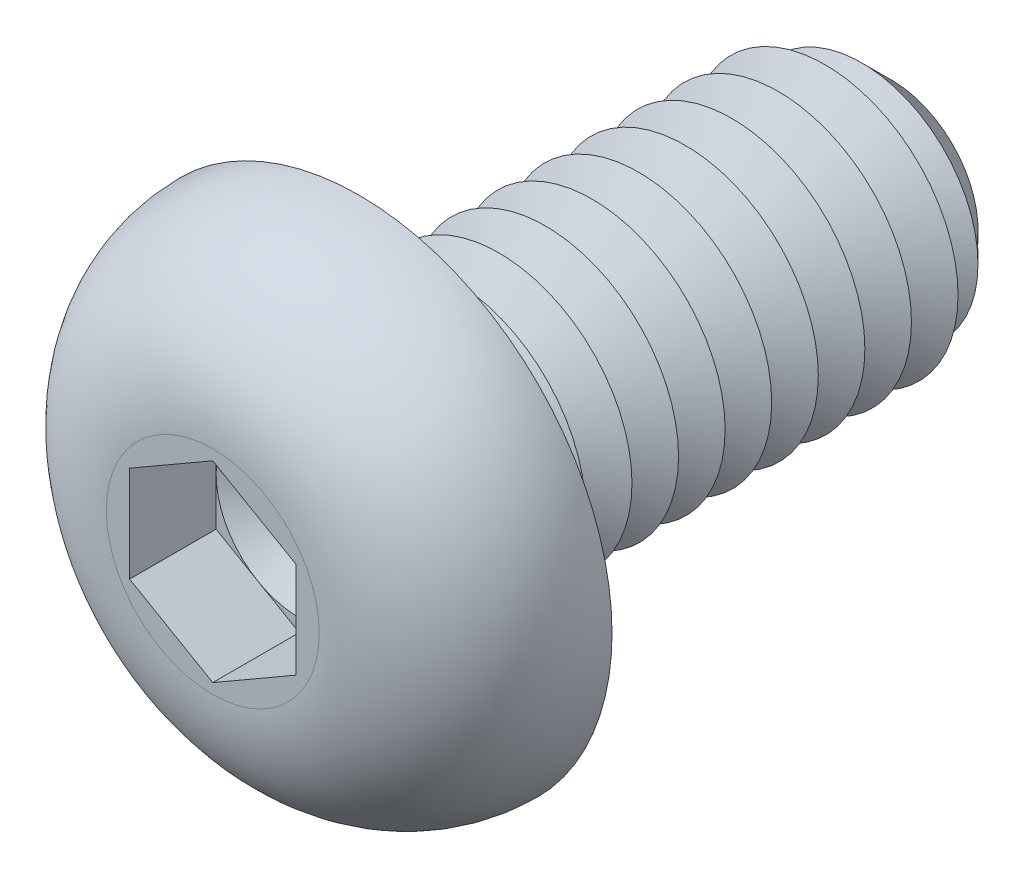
ISO-10303-21;
HEADER;
FILE_DESCRIPTION(('STEP AP214'),'2;1');
FILE_NAME('part.step','',(''),(''),'','','');
FILE_SCHEMA(('AUTOMOTIVE_DESIGN { 1 0 10303 214 1 1 1 1 }'));
ENDSEC;
DATA;
#1=APPLICATION_CONTEXT('core data for automotive mechanical design processes');
#2=APPLICATION_PROTOCOL_DEFINITION('international standard','automotive_design',2000,#1);
#3=PRODUCT_CONTEXT('',#1,'mechanical');
#4=PRODUCT('Part','Part','',(#3));
#5=PRODUCT_RELATED_PRODUCT_CATEGORY('part','',(#4));
#6=PRODUCT_DEFINITION_FORMATION('','',#4);
#7=PRODUCT_DEFINITION_CONTEXT('part definition',#1,'design');
#8=PRODUCT_DEFINITION('design','',#6,#7);
#9=PRODUCT_DEFINITION_SHAPE('','',#8);
#10=(LENGTH_UNIT() NAMED_UNIT(*) SI_UNIT(.MILLI.,.METRE.));
#11=(NAMED_UNIT(*) PLANE_ANGLE_UNIT() SI_UNIT($,.RADIAN.));
#12=(NAMED_UNIT(*) SI_UNIT($,.STERADIAN.) SOLID_ANGLE_UNIT());
#13=UNCERTAINTY_MEASURE_WITH_UNIT(LENGTH_MEASURE(1.E-05),#10,'distance_accuracy_value','');
#14=(GEOMETRIC_REPRESENTATION_CONTEXT(3) GLOBAL_UNCERTAINTY_ASSIGNED_CONTEXT((#13)) GLOBAL_UNIT_ASSIGNED_CONTEXT((#10,
#11,#12)) REPRESENTATION_CONTEXT('',''));
#15=CARTESIAN_POINT('',(0.,0.,0.));
#16=DIRECTION('',(0.,0.,1.));
#17=DIRECTION('',(1.,0.,0.));
#18=AXIS2_PLACEMENT_3D('',#15,#16,#17);
#19=CARTESIAN_POINT('',(0.,0.,0.900000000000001));
#20=DIRECTION('',(0.,0.,1.));
#21=DIRECTION('',(1.,0.,0.));
#22=AXIS2_PLACEMENT_3D('',#19,#20,#21);
#23=PLANE('',#22);
#24=CARTESIAN_POINT('',(0.,0.,0.900000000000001));
#25=DIRECTION('',(0.,0.,1.));
#26=DIRECTION('',(1.,0.,0.));
#27=AXIS2_PLACEMENT_3D('',#24,#25,#26);
#28=CIRCLE('',#27,1.25);
#29=CARTESIAN_POINT('',(1.25,0.,0.900000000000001));
#30=VERTEX_POINT('',#29);
#31=CARTESIAN_POINT('',(0.625,1.08253175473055,0.900000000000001));
#32=VERTEX_POINT('',#31);
#33=EDGE_CURVE('E117',#30,#32,#28,.T.);
#34=ORIENTED_EDGE('',*,*,#33,.F.);
#35=DIRECTION('',(0.,1.,0.));
#36=VECTOR('',#35,1.);
#37=CARTESIAN_POINT('',(1.25,-0.721687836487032,0.900000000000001));
#38=LINE('',#37,#36);
#39=CARTESIAN_POINT('',(1.25,0.721687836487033,0.900000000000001));
#40=VERTEX_POINT('',#39);
#41=EDGE_CURVE('E140',#30,#40,#38,.T.);
#42=ORIENTED_EDGE('',*,*,#41,.T.);
#43=DIRECTION('',(-0.866025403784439,0.5,0.));
#44=VECTOR('',#43,1.);
#45=CARTESIAN_POINT('',(1.25,0.721687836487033,0.900000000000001));
#46=LINE('',#45,#44);
#47=EDGE_CURVE('E135',#40,#32,#46,.T.);
#48=ORIENTED_EDGE('',*,*,#47,.T.);
#49=EDGE_LOOP('',(#34,#42,#48));
#50=FACE_BOUND('',#49,.T.);
#51=ADVANCED_FACE('F39',(#50),#23,.T.);
#52=CARTESIAN_POINT('',(0.,0.,0.900000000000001));
#53=DIRECTION('',(0.,0.,1.));
#54=DIRECTION('',(1.,0.,0.));
#55=AXIS2_PLACEMENT_3D('',#52,#53,#54);
#56=CIRCLE('',#55,1.25);
#57=CARTESIAN_POINT('',(-0.625,1.08253175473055,0.900000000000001));
#58=VERTEX_POINT('',#57);
#59=EDGE_CURVE('E11',#32,#58,#56,.T.);
#60=ORIENTED_EDGE('',*,*,#59,.F.);
#61=CARTESIAN_POINT('',(0.,1.44337567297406,0.900000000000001));
#62=VERTEX_POINT('',#61);
#63=EDGE_CURVE('E130',#32,#62,#46,.T.);
#64=ORIENTED_EDGE('',*,*,#63,.T.);
#65=DIRECTION('',(-0.866025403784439,-0.5,0.));
#66=VECTOR('',#65,1.);
#67=CARTESIAN_POINT('',(0.,1.44337567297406,0.900000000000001));
#68=LINE('',#67,#66);
#69=EDGE_CURVE('E132',#62,#58,#68,.T.);
#70=ORIENTED_EDGE('',*,*,#69,.T.);
#71=EDGE_LOOP('',(#60,#64,#70));
#72=FACE_BOUND('',#71,.T.);
#73=ADVANCED_FACE('F129',(#72),#23,.T.);
#74=CARTESIAN_POINT('',(-1.25,0.,0.900000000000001));
#75=VERTEX_POINT('',#74);
#76=EDGE_CURVE('E49',#58,#75,#56,.T.);
#77=ORIENTED_EDGE('',*,*,#76,.F.);
#78=CARTESIAN_POINT('',(-1.25,0.721687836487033,0.900000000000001));
#79=VERTEX_POINT('',#78);
#80=EDGE_CURVE('E143',#58,#79,#68,.T.);
#81=ORIENTED_EDGE('',*,*,#80,.T.);
#82=DIRECTION('',(0.,-1.,0.));
#83=VECTOR('',#82,1.);
#84=CARTESIAN_POINT('',(-1.25,0.721687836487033,0.900000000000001));
#85=LINE('',#84,#83);
#86=EDGE_CURVE('E153',#79,#75,#85,.T.);
#87=ORIENTED_EDGE('',*,*,#86,.T.);
#88=EDGE_LOOP('',(#77,#81,#87));
#89=FACE_BOUND('',#88,.T.);
#90=ADVANCED_FACE('F253',(#89),#23,.T.);
#91=CARTESIAN_POINT('',(-0.625,-1.08253175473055,0.900000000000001));
#92=VERTEX_POINT('',#91);
#93=EDGE_CURVE('E238',#75,#92,#56,.T.);
#94=ORIENTED_EDGE('',*,*,#93,.F.);
#95=CARTESIAN_POINT('',(-1.25,-0.721687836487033,0.900000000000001));
#96=VERTEX_POINT('',#95);
#97=EDGE_CURVE('E152',#75,#96,#85,.T.);
#98=ORIENTED_EDGE('',*,*,#97,.T.);
#99=DIRECTION('',(0.866025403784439,-0.5,0.));
#100=VECTOR('',#99,1.);
#101=CARTESIAN_POINT('',(-1.25,-0.721687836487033,0.900000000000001));
#102=LINE('',#101,#100);
#103=EDGE_CURVE('E158',#96,#92,#102,.T.);
#104=ORIENTED_EDGE('',*,*,#103,.T.);
#105=EDGE_LOOP('',(#94,#98,#104));
#106=FACE_BOUND('',#105,.T.);
#107=ADVANCED_FACE('F246',(#106),#23,.T.);
#108=CARTESIAN_POINT('',(0.625,-1.08253175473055,0.900000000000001));
#109=VERTEX_POINT('',#108);
#110=EDGE_CURVE('E56',#92,#109,#56,.T.);
#111=ORIENTED_EDGE('',*,*,#110,.F.);
#112=CARTESIAN_POINT('',(0.,-1.44337567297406,0.900000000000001));
#113=VERTEX_POINT('',#112);
#114=EDGE_CURVE('E157',#92,#113,#102,.T.);
#115=ORIENTED_EDGE('',*,*,#114,.T.);
#116=DIRECTION('',(0.866025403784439,0.5,0.));
#117=VECTOR('',#116,1.);
#118=CARTESIAN_POINT('',(0.,-1.44337567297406,0.900000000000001));
#119=LINE('',#118,#117);
#120=EDGE_CURVE('E163',#113,#109,#119,.T.);
#121=ORIENTED_EDGE('',*,*,#120,.T.);
#122=EDGE_LOOP('',(#111,#115,#121));
#123=FACE_BOUND('',#122,.T.);
#124=ADVANCED_FACE('F367',(#123),#23,.T.);
#125=CARTESIAN_POINT('',(0.,0.,-8.));
#126=DIRECTION('',(0.,0.,1.));
#127=DIRECTION('',(1.,0.,0.));
#128=AXIS2_PLACEMENT_3D('',#125,#126,#127);
#129=CYLINDRICAL_SURFACE('',#128,2.);
#130=CARTESIAN_POINT('',(0.,0.,-0.3));
#131=DIRECTION('',(0.,0.,1.));
#132=DIRECTION('',(1.,0.,0.));
#133=AXIS2_PLACEMENT_3D('',#130,#131,#132);
#134=CIRCLE('',#133,2.);
#135=CARTESIAN_POINT('',(2.,0.,-0.3));
#136=VERTEX_POINT('',#135);
#137=EDGE_CURVE('E221',#136,#136,#134,.F.);
#138=ORIENTED_EDGE('',*,*,#137,.T.);
#139=EDGE_LOOP('',(#138));
#140=FACE_BOUND('',#139,.T.);
#141=CARTESIAN_POINT('',(0.,0.,-0.699999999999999));
#142=DIRECTION('',(0.,0.,1.));
#143=DIRECTION('',(1.,0.,0.));
#144=AXIS2_PLACEMENT_3D('',#141,#142,#143);
#145=CIRCLE('',#144,2.);
#146=CARTESIAN_POINT('',(2.,0.,-0.699999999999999));
#147=VERTEX_POINT('',#146);
#148=EDGE_CURVE('E148',#147,#147,#145,.T.);
#149=ORIENTED_EDGE('',*,*,#148,.T.);
#150=EDGE_LOOP('',(#149));
#151=FACE_BOUND('',#150,.T.);
#152=ADVANCED_FACE('F376',(#140,#151),#129,.T.);
#153=CARTESIAN_POINT('',(0.,3.8,0.));
#154=DIRECTION('',(0.,0.,1.));
#155=DIRECTION('',(1.,0.,0.));
#156=AXIS2_PLACEMENT_3D('',#153,#154,#155);
#157=PLANE('',#156);
#158=CARTESIAN_POINT('',(0.,0.,0.));
#159=DIRECTION('',(0.,0.,1.));
#160=DIRECTION('',(1.,0.,0.));
#161=AXIS2_PLACEMENT_3D('',#158,#159,#160);
#162=CIRCLE('',#161,2.3);
#163=CARTESIAN_POINT('',(2.3,0.,0.));
#164=VERTEX_POINT('',#163);
#165=EDGE_CURVE('E230',#164,#164,#162,.T.);
#166=ORIENTED_EDGE('',*,*,#165,.T.);
#167=EDGE_LOOP('',(#166));
#168=FACE_BOUND('',#167,.T.);
#169=CARTESIAN_POINT('',(0.,0.,0.));
#170=DIRECTION('',(0.,0.,1.));
#171=DIRECTION('',(1.,0.,0.));
#172=AXIS2_PLACEMENT_3D('',#169,#170,#171);
#173=CIRCLE('',#172,3.8);
#174=CARTESIAN_POINT('',(3.8,0.,0.));
#175=VERTEX_POINT('',#174);
#176=EDGE_CURVE('E195',#175,#175,#173,.T.);
#177=ORIENTED_EDGE('',*,*,#176,.F.);
#178=EDGE_LOOP('',(#177));
#179=FACE_BOUND('',#178,.T.);
#180=ADVANCED_FACE('F381',(#168,#179),#157,.F.);
#181=CARTESIAN_POINT('',(0.,0.,2.2));
#182=DIRECTION('',(0.,0.,-1.));
#183=DIRECTION('',(-1.,0.,0.));
#184=AXIS2_PLACEMENT_3D('',#181,#182,#183);
#185=PLANE('',#184);
#186=DIRECTION('',(-0.866025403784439,-0.5,0.));
#187=VECTOR('',#186,1.);
#188=CARTESIAN_POINT('',(0.,1.44337567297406,2.2));
#189=LINE('',#188,#187);
#190=CARTESIAN_POINT('',(0.,1.44337567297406,2.2));
#191=VERTEX_POINT('',#190);
#192=CARTESIAN_POINT('',(-1.25,0.721687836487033,2.2));
#193=VERTEX_POINT('',#192);
#194=EDGE_CURVE('E173',#191,#193,#189,.T.);
#195=ORIENTED_EDGE('',*,*,#194,.F.);
#196=DIRECTION('',(-0.866025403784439,0.5,0.));
#197=VECTOR('',#196,1.);
#198=CARTESIAN_POINT('',(1.25,0.721687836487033,2.2));
#199=LINE('',#198,#197);
#200=CARTESIAN_POINT('',(1.25,0.721687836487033,2.2));
#201=VERTEX_POINT('',#200);
#202=EDGE_CURVE('E64',#201,#191,#199,.T.);
#203=ORIENTED_EDGE('',*,*,#202,.F.);
#204=DIRECTION('',(0.,1.,0.));
#205=VECTOR('',#204,1.);
#206=CARTESIAN_POINT('',(1.25,-0.721687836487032,2.2));
#207=LINE('',#206,#205);
#208=CARTESIAN_POINT('',(1.25,-0.721687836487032,2.2));
#209=VERTEX_POINT('',#208);
#210=EDGE_CURVE('E138',#209,#201,#207,.T.);
#211=ORIENTED_EDGE('',*,*,#210,.F.);
#212=DIRECTION('',(0.866025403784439,0.5,0.));
#213=VECTOR('',#212,1.);
#214=CARTESIAN_POINT('',(0.,-1.44337567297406,2.2));
#215=LINE('',#214,#213);
#216=CARTESIAN_POINT('',(0.,-1.44337567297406,2.2));
#217=VERTEX_POINT('',#216);
#218=EDGE_CURVE('E185',#217,#209,#215,.T.);
#219=ORIENTED_EDGE('',*,*,#218,.F.);
#220=DIRECTION('',(0.866025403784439,-0.5,0.));
#221=VECTOR('',#220,1.);
#222=CARTESIAN_POINT('',(-1.25,-0.721687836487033,2.2));
#223=LINE('',#222,#221);
#224=CARTESIAN_POINT('',(-1.25,-0.721687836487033,2.2));
#225=VERTEX_POINT('',#224);
#226=EDGE_CURVE('E181',#225,#217,#223,.T.);
#227=ORIENTED_EDGE('',*,*,#226,.F.);
#228=DIRECTION('',(0.,-1.,0.));
#229=VECTOR('',#228,1.);
#230=CARTESIAN_POINT('',(-1.25,0.721687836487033,2.2));
#231=LINE('',#230,#229);
#232=EDGE_CURVE('E177',#193,#225,#231,.T.);
#233=ORIENTED_EDGE('',*,*,#232,.F.);
#234=EDGE_LOOP('',(#195,#203,#211,#219,#227,#233));
#235=FACE_BOUND('',#234,.T.);
#236=CARTESIAN_POINT('',(0.,0.,2.2));
#237=DIRECTION('',(0.,0.,1.));
#238=DIRECTION('',(1.,0.,0.));
#239=AXIS2_PLACEMENT_3D('',#236,#237,#238);
#240=CIRCLE('',#239,1.6);
#241=CARTESIAN_POINT('',(1.6,0.,2.2));
#242=VERTEX_POINT('',#241);
#243=EDGE_CURVE('E213',#242,#242,#240,.T.);
#244=ORIENTED_EDGE('',*,*,#243,.T.);
#245=EDGE_LOOP('',(#244));
#246=FACE_BOUND('',#245,.T.);
#247=ADVANCED_FACE('F262',(#235,#246),#185,.F.);
#248=CARTESIAN_POINT('',(0.,0.,0.));
#249=DIRECTION('',(0.,0.,1.));
#250=DIRECTION('',(1.,0.,0.));
#251=AXIS2_PLACEMENT_3D('',#248,#249,#250);
#252=DEGENERATE_TOROIDAL_SURFACE('',#251,1.6,2.2,.T.);
#253=ORIENTED_EDGE('',*,*,#243,.F.);
#254=EDGE_LOOP('',(#253));
#255=FACE_BOUND('',#254,.T.);
#256=ORIENTED_EDGE('',*,*,#176,.T.);
#257=EDGE_LOOP('',(#256));
#258=FACE_BOUND('',#257,.T.);
#259=ADVANCED_FACE('F610',(#255,#258),#252,.T.);
#260=CARTESIAN_POINT('',(1.25,0.721687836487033,0.900000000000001));
#261=DIRECTION('',(0.5,0.866025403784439,0.));
#262=DIRECTION('',(-0.866025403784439,0.5,0.));
#263=AXIS2_PLACEMENT_3D('',#260,#261,#262);
#264=PLANE('',#263);
#265=ORIENTED_EDGE('',*,*,#202,.T.);
#266=DIRECTION('',(0.,0.,1.));
#267=VECTOR('',#266,1.);
#268=CARTESIAN_POINT('',(0.,1.44337567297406,0.900000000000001));
#269=LINE('',#268,#267);
#270=EDGE_CURVE('E136',#62,#191,#269,.T.);
#271=ORIENTED_EDGE('',*,*,#270,.F.);
#272=ORIENTED_EDGE('',*,*,#63,.F.);
#273=ORIENTED_EDGE('',*,*,#47,.F.);
#274=DIRECTION('',(0.,0.,1.));
#275=VECTOR('',#274,1.);
#276=CARTESIAN_POINT('',(1.25,0.721687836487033,0.900000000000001));
#277=LINE('',#276,#275);
#278=EDGE_CURVE('E192',#40,#201,#277,.T.);
#279=ORIENTED_EDGE('',*,*,#278,.T.);
#280=EDGE_LOOP('',(#265,#271,#272,#273,#279));
#281=FACE_BOUND('',#280,.T.);
#282=ADVANCED_FACE('F134',(#281),#264,.F.);
#283=CARTESIAN_POINT('',(1.25,-0.721687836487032,0.900000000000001));
#284=DIRECTION('',(1.,0.,0.));
#285=DIRECTION('',(0.,1.,0.));
#286=AXIS2_PLACEMENT_3D('',#283,#284,#285);
#287=PLANE('',#286);
#288=ORIENTED_EDGE('',*,*,#210,.T.);
#289=ORIENTED_EDGE('',*,*,#278,.F.);
#290=ORIENTED_EDGE('',*,*,#41,.F.);
#291=CARTESIAN_POINT('',(1.25,-0.721687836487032,0.900000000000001));
#292=VERTEX_POINT('',#291);
#293=EDGE_CURVE('E167',#292,#30,#38,.T.);
#294=ORIENTED_EDGE('',*,*,#293,.F.);
#295=DIRECTION('',(0.,0.,1.));
#296=VECTOR('',#295,1.);
#297=CARTESIAN_POINT('',(1.25,-0.721687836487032,0.900000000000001));
#298=LINE('',#297,#296);
#299=EDGE_CURVE('E196',#292,#209,#298,.T.);
#300=ORIENTED_EDGE('',*,*,#299,.T.);
#301=EDGE_LOOP('',(#288,#289,#290,#294,#300));
#302=FACE_BOUND('',#301,.T.);
#303=ADVANCED_FACE('F389',(#302),#287,.F.);
#304=CARTESIAN_POINT('',(0.,-1.44337567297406,0.900000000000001));
#305=DIRECTION('',(0.5,-0.866025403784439,0.));
#306=DIRECTION('',(0.866025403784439,0.5,0.));
#307=AXIS2_PLACEMENT_3D('',#304,#305,#306);
#308=PLANE('',#307);
#309=ORIENTED_EDGE('',*,*,#218,.T.);
#310=ORIENTED_EDGE('',*,*,#299,.F.);
#311=EDGE_CURVE('E162',#109,#292,#119,.T.);
#312=ORIENTED_EDGE('',*,*,#311,.F.);
#313=ORIENTED_EDGE('',*,*,#120,.F.);
#314=DIRECTION('',(0.,0.,1.));
#315=VECTOR('',#314,1.);
#316=CARTESIAN_POINT('',(0.,-1.44337567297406,0.900000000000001));
#317=LINE('',#316,#315);
#318=EDGE_CURVE('E199',#113,#217,#317,.T.);
#319=ORIENTED_EDGE('',*,*,#318,.T.);
#320=EDGE_LOOP('',(#309,#310,#312,#313,#319));
#321=FACE_BOUND('',#320,.T.);
#322=ADVANCED_FACE('F385',(#321),#308,.F.);
#323=CARTESIAN_POINT('',(-1.25,-0.721687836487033,0.900000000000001));
#324=DIRECTION('',(-0.5,-0.866025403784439,0.));
#325=DIRECTION('',(0.866025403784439,-0.5,0.));
#326=AXIS2_PLACEMENT_3D('',#323,#324,#325);
#327=PLANE('',#326);
#328=ORIENTED_EDGE('',*,*,#226,.T.);
#329=ORIENTED_EDGE('',*,*,#318,.F.);
#330=ORIENTED_EDGE('',*,*,#114,.F.);
#331=ORIENTED_EDGE('',*,*,#103,.F.);
#332=DIRECTION('',(0.,0.,1.));
#333=VECTOR('',#332,1.);
#334=CARTESIAN_POINT('',(-1.25,-0.721687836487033,0.900000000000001));
#335=LINE('',#334,#333);
#336=EDGE_CURVE('E202',#96,#225,#335,.T.);
#337=ORIENTED_EDGE('',*,*,#336,.T.);
#338=EDGE_LOOP('',(#328,#329,#330,#331,#337));
#339=FACE_BOUND('',#338,.T.);
#340=ADVANCED_FACE('F267',(#339),#327,.F.);
#341=CARTESIAN_POINT('',(-1.25,0.721687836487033,0.900000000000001));
#342=DIRECTION('',(-1.,0.,0.));
#343=DIRECTION('',(0.,0.,1.));
#344=AXIS2_PLACEMENT_3D('',#341,#342,#343);
#345=PLANE('',#344);
#346=ORIENTED_EDGE('',*,*,#232,.T.);
#347=ORIENTED_EDGE('',*,*,#336,.F.);
#348=ORIENTED_EDGE('',*,*,#97,.F.);
#349=ORIENTED_EDGE('',*,*,#86,.F.);
#350=DIRECTION('',(0.,0.,1.));
#351=VECTOR('',#350,1.);
#352=CARTESIAN_POINT('',(-1.25,0.721687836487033,0.900000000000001));
#353=LINE('',#352,#351);
#354=EDGE_CURVE('E205',#79,#193,#353,.T.);
#355=ORIENTED_EDGE('',*,*,#354,.T.);
#356=EDGE_LOOP('',(#346,#347,#348,#349,#355));
#357=FACE_BOUND('',#356,.T.);
#358=ADVANCED_FACE('F251',(#357),#345,.F.);
#359=CARTESIAN_POINT('',(0.,1.44337567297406,0.900000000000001));
#360=DIRECTION('',(-0.5,0.866025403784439,0.));
#361=DIRECTION('',(-0.866025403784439,-0.5,0.));
#362=AXIS2_PLACEMENT_3D('',#359,#360,#361);
#363=PLANE('',#362);
#364=ORIENTED_EDGE('',*,*,#194,.T.);
#365=ORIENTED_EDGE('',*,*,#354,.F.);
#366=ORIENTED_EDGE('',*,*,#80,.F.);
#367=ORIENTED_EDGE('',*,*,#69,.F.);
#368=ORIENTED_EDGE('',*,*,#270,.T.);
#369=EDGE_LOOP('',(#364,#365,#366,#367,#368));
#370=FACE_BOUND('',#369,.T.);
#371=ADVANCED_FACE('F256',(#370),#363,.F.);
#372=EDGE_CURVE('E43',#109,#30,#56,.T.);
#373=ORIENTED_EDGE('',*,*,#372,.F.);
#374=ORIENTED_EDGE('',*,*,#311,.T.);
#375=ORIENTED_EDGE('',*,*,#293,.T.);
#376=EDGE_LOOP('',(#373,#374,#375));
#377=FACE_BOUND('',#376,.T.);
#378=ADVANCED_FACE('F359',(#377),#23,.T.);
#379=CARTESIAN_POINT('',(0.,0.,-0.699999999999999));
#380=DIRECTION('',(0.,0.,1.));
#381=DIRECTION('',(1.,0.,0.));
#382=AXIS2_PLACEMENT_3D('',#379,#380,#381);
#383=CONICAL_SURFACE('',#382,2.,1.04719755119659);
#384=CARTESIAN_POINT('',(0.,0.,-1.05));
#385=DIRECTION('',(0.,0.,1.));
#386=DIRECTION('',(1.,0.,0.));
#387=AXIS2_PLACEMENT_3D('',#384,#385,#386);
#388=CIRCLE('',#387,1.3937822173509);
#389=CARTESIAN_POINT('',(1.3937822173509,0.,-1.05));
#390=VERTEX_POINT('',#389);
#391=EDGE_CURVE('E277',#390,#390,#388,.T.);
#392=ORIENTED_EDGE('',*,*,#391,.T.);
#393=EDGE_LOOP('',(#392));
#394=FACE_BOUND('',#393,.T.);
#395=ORIENTED_EDGE('',*,*,#148,.F.);
#396=EDGE_LOOP('',(#395));
#397=FACE_BOUND('',#396,.T.);
#398=ADVANCED_FACE('F355',(#394,#397),#383,.T.);
#399=CARTESIAN_POINT('',(0.,0.,-1.05));
#400=DIRECTION('',(0.,0.,-1.));
#401=DIRECTION('',(-1.,0.,0.));
#402=AXIS2_PLACEMENT_3D('',#399,#400,#401);
#403=CONICAL_SURFACE('',#402,1.3937822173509,1.0471975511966);
#404=CARTESIAN_POINT('',(0.,0.,-1.4));
#405=DIRECTION('',(0.,0.,1.));
#406=DIRECTION('',(1.,0.,0.));
#407=AXIS2_PLACEMENT_3D('',#404,#405,#406);
#408=CIRCLE('',#407,2.);
#409=CARTESIAN_POINT('',(2.,0.,-1.4));
#410=VERTEX_POINT('',#409);
#411=EDGE_CURVE('E280',#410,#410,#408,.T.);
#412=ORIENTED_EDGE('',*,*,#411,.T.);
#413=EDGE_LOOP('',(#412));
#414=FACE_BOUND('',#413,.T.);
#415=ORIENTED_EDGE('',*,*,#391,.F.);
#416=EDGE_LOOP('',(#415));
#417=FACE_BOUND('',#416,.T.);
#418=ADVANCED_FACE('F340',(#414,#417),#403,.T.);
#419=CARTESIAN_POINT('',(0.,0.,-1.4));
#420=DIRECTION('',(0.,0.,1.));
#421=DIRECTION('',(1.,0.,0.));
#422=AXIS2_PLACEMENT_3D('',#419,#420,#421);
#423=CONICAL_SURFACE('',#422,2.,1.04719755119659);
#424=CARTESIAN_POINT('',(0.,0.,-1.75));
#425=DIRECTION('',(0.,0.,1.));
#426=DIRECTION('',(1.,0.,0.));
#427=AXIS2_PLACEMENT_3D('',#424,#425,#426);
#428=CIRCLE('',#427,1.3937822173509);
#429=CARTESIAN_POINT('',(1.3937822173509,0.,-1.75));
#430=VERTEX_POINT('',#429);
#431=EDGE_CURVE('E332',#430,#430,#428,.T.);
#432=ORIENTED_EDGE('',*,*,#431,.T.);
#433=EDGE_LOOP('',(#432));
#434=FACE_BOUND('',#433,.T.);
#435=ORIENTED_EDGE('',*,*,#411,.F.);
#436=EDGE_LOOP('',(#435));
#437=FACE_BOUND('',#436,.T.);
#438=ADVANCED_FACE('F343',(#434,#437),#423,.T.);
#439=CARTESIAN_POINT('',(0.,0.,-1.75));
#440=DIRECTION('',(0.,0.,-1.));
#441=DIRECTION('',(-1.,0.,0.));
#442=AXIS2_PLACEMENT_3D('',#439,#440,#441);
#443=CONICAL_SURFACE('',#442,1.3937822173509,1.0471975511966);
#444=CARTESIAN_POINT('',(0.,0.,-2.1));
#445=DIRECTION('',(0.,0.,1.));
#446=DIRECTION('',(1.,0.,0.));
#447=AXIS2_PLACEMENT_3D('',#444,#445,#446);
#448=CIRCLE('',#447,2.);
#449=CARTESIAN_POINT('',(2.,0.,-2.1));
#450=VERTEX_POINT('',#449);
#451=EDGE_CURVE('E328',#450,#450,#448,.T.);
#452=ORIENTED_EDGE('',*,*,#451,.T.);
#453=EDGE_LOOP('',(#452));
#454=FACE_BOUND('',#453,.T.);
#455=ORIENTED_EDGE('',*,*,#431,.F.);
#456=EDGE_LOOP('',(#455));
#457=FACE_BOUND('',#456,.T.);
#458=ADVANCED_FACE('F345',(#454,#457),#443,.T.);
#459=CARTESIAN_POINT('',(0.,0.,-2.1));
#460=DIRECTION('',(0.,0.,1.));
#461=DIRECTION('',(1.,0.,0.));
#462=AXIS2_PLACEMENT_3D('',#459,#460,#461);
#463=CONICAL_SURFACE('',#462,2.,1.04719755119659);
#464=CARTESIAN_POINT('',(0.,0.,-2.45));
#465=DIRECTION('',(0.,0.,1.));
#466=DIRECTION('',(1.,0.,0.));
#467=AXIS2_PLACEMENT_3D('',#464,#465,#466);
#468=CIRCLE('',#467,1.3937822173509);
#469=CARTESIAN_POINT('',(1.3937822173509,0.,-2.45));
#470=VERTEX_POINT('',#469);
#471=EDGE_CURVE('E324',#470,#470,#468,.T.);
#472=ORIENTED_EDGE('',*,*,#471,.T.);
#473=EDGE_LOOP('',(#472));
#474=FACE_BOUND('',#473,.T.);
#475=ORIENTED_EDGE('',*,*,#451,.F.);
#476=EDGE_LOOP('',(#475));
#477=FACE_BOUND('',#476,.T.);
#478=ADVANCED_FACE('F352',(#474,#477),#463,.T.);
#479=CARTESIAN_POINT('',(0.,0.,-2.45));
#480=DIRECTION('',(0.,0.,-1.));
#481=DIRECTION('',(-1.,0.,0.));
#482=AXIS2_PLACEMENT_3D('',#479,#480,#481);
#483=CONICAL_SURFACE('',#482,1.3937822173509,1.0471975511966);
#484=CARTESIAN_POINT('',(0.,0.,-2.8));
#485=DIRECTION('',(0.,0.,1.));
#486=DIRECTION('',(1.,0.,0.));
#487=AXIS2_PLACEMENT_3D('',#484,#485,#486);
#488=CIRCLE('',#487,2.);
#489=CARTESIAN_POINT('',(2.,0.,-2.8));
#490=VERTEX_POINT('',#489);
#491=EDGE_CURVE('E320',#490,#490,#488,.T.);
#492=ORIENTED_EDGE('',*,*,#491,.T.);
#493=EDGE_LOOP('',(#492));
#494=FACE_BOUND('',#493,.T.);
#495=ORIENTED_EDGE('',*,*,#471,.F.);
#496=EDGE_LOOP('',(#495));
#497=FACE_BOUND('',#496,.T.);
#498=ADVANCED_FACE('F464',(#494,#497),#483,.T.);
#499=CARTESIAN_POINT('',(0.,0.,-2.8));
#500=DIRECTION('',(0.,0.,1.));
#501=DIRECTION('',(1.,0.,0.));
#502=AXIS2_PLACEMENT_3D('',#499,#500,#501);
#503=CONICAL_SURFACE('',#502,2.,1.04719755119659);
#504=CARTESIAN_POINT('',(0.,0.,-3.15));
#505=DIRECTION('',(0.,0.,1.));
#506=DIRECTION('',(1.,0.,0.));
#507=AXIS2_PLACEMENT_3D('',#504,#505,#506);
#508=CIRCLE('',#507,1.3937822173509);
#509=CARTESIAN_POINT('',(1.3937822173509,0.,-3.15));
#510=VERTEX_POINT('',#509);
#511=EDGE_CURVE('E316',#510,#510,#508,.T.);
#512=ORIENTED_EDGE('',*,*,#511,.T.);
#513=EDGE_LOOP('',(#512));
#514=FACE_BOUND('',#513,.T.);
#515=ORIENTED_EDGE('',*,*,#491,.F.);
#516=EDGE_LOOP('',(#515));
#517=FACE_BOUND('',#516,.T.);
#518=ADVANCED_FACE('F460',(#514,#517),#503,.T.);
#519=CARTESIAN_POINT('',(0.,0.,-3.15));
#520=DIRECTION('',(0.,0.,-1.));
#521=DIRECTION('',(-1.,0.,0.));
#522=AXIS2_PLACEMENT_3D('',#519,#520,#521);
#523=CONICAL_SURFACE('',#522,1.3937822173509,1.0471975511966);
#524=CARTESIAN_POINT('',(0.,0.,-3.5));
#525=DIRECTION('',(0.,0.,1.));
#526=DIRECTION('',(1.,0.,0.));
#527=AXIS2_PLACEMENT_3D('',#524,#525,#526);
#528=CIRCLE('',#527,2.);
#529=CARTESIAN_POINT('',(2.,0.,-3.5));
#530=VERTEX_POINT('',#529);
#531=EDGE_CURVE('E312',#530,#530,#528,.T.);
#532=ORIENTED_EDGE('',*,*,#531,.T.);
#533=EDGE_LOOP('',(#532));
#534=FACE_BOUND('',#533,.T.);
#535=ORIENTED_EDGE('',*,*,#511,.F.);
#536=EDGE_LOOP('',(#535));
#537=FACE_BOUND('',#536,.T.);
#538=ADVANCED_FACE('F456',(#534,#537),#523,.T.);
#539=CARTESIAN_POINT('',(0.,0.,-3.5));
#540=DIRECTION('',(0.,0.,1.));
#541=DIRECTION('',(1.,0.,0.));
#542=AXIS2_PLACEMENT_3D('',#539,#540,#541);
#543=CONICAL_SURFACE('',#542,2.,1.04719755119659);
#544=CARTESIAN_POINT('',(0.,0.,-3.85));
#545=DIRECTION('',(0.,0.,1.));
#546=DIRECTION('',(1.,0.,0.));
#547=AXIS2_PLACEMENT_3D('',#544,#545,#546);
#548=CIRCLE('',#547,1.3937822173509);
#549=CARTESIAN_POINT('',(1.3937822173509,0.,-3.85));
#550=VERTEX_POINT('',#549);
#551=EDGE_CURVE('E283',#550,#550,#548,.T.);
#552=ORIENTED_EDGE('',*,*,#551,.T.);
#553=EDGE_LOOP('',(#552));
#554=FACE_BOUND('',#553,.T.);
#555=ORIENTED_EDGE('',*,*,#531,.F.);
#556=EDGE_LOOP('',(#555));
#557=FACE_BOUND('',#556,.T.);
#558=ADVANCED_FACE('F452',(#554,#557),#543,.T.);
#559=CARTESIAN_POINT('',(0.,0.,-3.85));
#560=DIRECTION('',(0.,0.,-1.));
#561=DIRECTION('',(-1.,0.,0.));
#562=AXIS2_PLACEMENT_3D('',#559,#560,#561);
#563=CONICAL_SURFACE('',#562,1.3937822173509,1.0471975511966);
#564=CARTESIAN_POINT('',(0.,0.,-4.2));
#565=DIRECTION('',(0.,0.,1.));
#566=DIRECTION('',(1.,0.,0.));
#567=AXIS2_PLACEMENT_3D('',#564,#565,#566);
#568=CIRCLE('',#567,2.);
#569=CARTESIAN_POINT('',(2.,0.,-4.2));
#570=VERTEX_POINT('',#569);
#571=EDGE_CURVE('E281',#570,#570,#568,.T.);
#572=ORIENTED_EDGE('',*,*,#571,.T.);
#573=EDGE_LOOP('',(#572));
#574=FACE_BOUND('',#573,.T.);
#575=ORIENTED_EDGE('',*,*,#551,.F.);
#576=EDGE_LOOP('',(#575));
#577=FACE_BOUND('',#576,.T.);
#578=ADVANCED_FACE('F448',(#574,#577),#563,.T.);
#579=CARTESIAN_POINT('',(0.,0.,-4.2));
#580=DIRECTION('',(0.,0.,1.));
#581=DIRECTION('',(1.,0.,0.));
#582=AXIS2_PLACEMENT_3D('',#579,#580,#581);
#583=CONICAL_SURFACE('',#582,2.,1.04719755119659);
#584=CARTESIAN_POINT('',(0.,0.,-4.55));
#585=DIRECTION('',(0.,0.,1.));
#586=DIRECTION('',(1.,0.,0.));
#587=AXIS2_PLACEMENT_3D('',#584,#585,#586);
#588=CIRCLE('',#587,1.3937822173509);
#589=CARTESIAN_POINT('',(1.3937822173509,0.,-4.55));
#590=VERTEX_POINT('',#589);
#591=EDGE_CURVE('E284',#590,#590,#588,.T.);
#592=ORIENTED_EDGE('',*,*,#591,.T.);
#593=EDGE_LOOP('',(#592));
#594=FACE_BOUND('',#593,.T.);
#595=ORIENTED_EDGE('',*,*,#571,.F.);
#596=EDGE_LOOP('',(#595));
#597=FACE_BOUND('',#596,.T.);
#598=ADVANCED_FACE('F444',(#594,#597),#583,.T.);
#599=CARTESIAN_POINT('',(0.,0.,-4.55));
#600=DIRECTION('',(0.,0.,-1.));
#601=DIRECTION('',(-1.,0.,0.));
#602=AXIS2_PLACEMENT_3D('',#599,#600,#601);
#603=CONICAL_SURFACE('',#602,1.3937822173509,1.0471975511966);
#604=CARTESIAN_POINT('',(0.,0.,-4.9));
#605=DIRECTION('',(0.,0.,1.));
#606=DIRECTION('',(1.,0.,0.));
#607=AXIS2_PLACEMENT_3D('',#604,#605,#606);
#608=CIRCLE('',#607,2.);
#609=CARTESIAN_POINT('',(2.,0.,-4.9));
#610=VERTEX_POINT('',#609);
#611=EDGE_CURVE('E295',#610,#610,#608,.T.);
#612=ORIENTED_EDGE('',*,*,#611,.T.);
#613=EDGE_LOOP('',(#612));
#614=FACE_BOUND('',#613,.T.);
#615=ORIENTED_EDGE('',*,*,#591,.F.);
#616=EDGE_LOOP('',(#615));
#617=FACE_BOUND('',#616,.T.);
#618=ADVANCED_FACE('F440',(#614,#617),#603,.T.);
#619=CARTESIAN_POINT('',(0.,0.,-4.9));
#620=DIRECTION('',(0.,0.,1.));
#621=DIRECTION('',(1.,0.,0.));
#622=AXIS2_PLACEMENT_3D('',#619,#620,#621);
#623=CONICAL_SURFACE('',#622,2.,1.04719755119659);
#624=CARTESIAN_POINT('',(0.,0.,-5.25));
#625=DIRECTION('',(0.,0.,1.));
#626=DIRECTION('',(1.,0.,0.));
#627=AXIS2_PLACEMENT_3D('',#624,#625,#626);
#628=CIRCLE('',#627,1.3937822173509);
#629=CARTESIAN_POINT('',(1.3937822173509,0.,-5.25));
#630=VERTEX_POINT('',#629);
#631=EDGE_CURVE('E288',#630,#630,#628,.T.);
#632=ORIENTED_EDGE('',*,*,#631,.T.);
#633=EDGE_LOOP('',(#632));
#634=FACE_BOUND('',#633,.T.);
#635=ORIENTED_EDGE('',*,*,#611,.F.);
#636=EDGE_LOOP('',(#635));
#637=FACE_BOUND('',#636,.T.);
#638=ADVANCED_FACE('F437',(#634,#637),#623,.T.);
#639=CARTESIAN_POINT('',(0.,0.,-5.25));
#640=DIRECTION('',(0.,0.,-1.));
#641=DIRECTION('',(-1.,0.,0.));
#642=AXIS2_PLACEMENT_3D('',#639,#640,#641);
#643=CONICAL_SURFACE('',#642,1.3937822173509,1.0471975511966);
#644=CARTESIAN_POINT('',(0.,0.,-5.6));
#645=DIRECTION('',(0.,0.,1.));
#646=DIRECTION('',(1.,0.,0.));
#647=AXIS2_PLACEMENT_3D('',#644,#645,#646);
#648=CIRCLE('',#647,2.);
#649=CARTESIAN_POINT('',(2.,0.,-5.6));
#650=VERTEX_POINT('',#649);
#651=EDGE_CURVE('E286',#650,#650,#648,.T.);
#652=ORIENTED_EDGE('',*,*,#651,.T.);
#653=EDGE_LOOP('',(#652));
#654=FACE_BOUND('',#653,.T.);
#655=ORIENTED_EDGE('',*,*,#631,.F.);
#656=EDGE_LOOP('',(#655));
#657=FACE_BOUND('',#656,.T.);
#658=ADVANCED_FACE('F433',(#654,#657),#643,.T.);
#659=CARTESIAN_POINT('',(0.,0.,-5.6));
#660=DIRECTION('',(0.,0.,1.));
#661=DIRECTION('',(1.,0.,0.));
#662=AXIS2_PLACEMENT_3D('',#659,#660,#661);
#663=CONICAL_SURFACE('',#662,2.,1.04719755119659);
#664=CARTESIAN_POINT('',(0.,0.,-5.95));
#665=DIRECTION('',(0.,0.,1.));
#666=DIRECTION('',(1.,0.,0.));
#667=AXIS2_PLACEMENT_3D('',#664,#665,#666);
#668=CIRCLE('',#667,1.3937822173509);
#669=CARTESIAN_POINT('',(1.3937822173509,0.,-5.95));
#670=VERTEX_POINT('',#669);
#671=EDGE_CURVE('E289',#670,#670,#668,.T.);
#672=ORIENTED_EDGE('',*,*,#671,.T.);
#673=EDGE_LOOP('',(#672));
#674=FACE_BOUND('',#673,.T.);
#675=ORIENTED_EDGE('',*,*,#651,.F.);
#676=EDGE_LOOP('',(#675));
#677=FACE_BOUND('',#676,.T.);
#678=ADVANCED_FACE('F429',(#674,#677),#663,.T.);
#679=CARTESIAN_POINT('',(0.,0.,-5.95));
#680=DIRECTION('',(0.,0.,-1.));
#681=DIRECTION('',(-1.,0.,0.));
#682=AXIS2_PLACEMENT_3D('',#679,#680,#681);
#683=CONICAL_SURFACE('',#682,1.3937822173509,1.0471975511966);
#684=CARTESIAN_POINT('',(0.,0.,-6.3));
#685=DIRECTION('',(0.,0.,1.));
#686=DIRECTION('',(1.,0.,0.));
#687=AXIS2_PLACEMENT_3D('',#684,#685,#686);
#688=CIRCLE('',#687,2.);
#689=CARTESIAN_POINT('',(2.,0.,-6.3));
#690=VERTEX_POINT('',#689);
#691=EDGE_CURVE('E299',#690,#690,#688,.T.);
#692=ORIENTED_EDGE('',*,*,#691,.T.);
#693=EDGE_LOOP('',(#692));
#694=FACE_BOUND('',#693,.T.);
#695=ORIENTED_EDGE('',*,*,#671,.F.);
#696=EDGE_LOOP('',(#695));
#697=FACE_BOUND('',#696,.T.);
#698=ADVANCED_FACE('F425',(#694,#697),#683,.T.);
#699=CARTESIAN_POINT('',(0.,0.,-6.3));
#700=DIRECTION('',(0.,0.,1.));
#701=DIRECTION('',(1.,0.,0.));
#702=AXIS2_PLACEMENT_3D('',#699,#700,#701);
#703=CONICAL_SURFACE('',#702,2.,1.04719755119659);
#704=CARTESIAN_POINT('',(0.,0.,-6.65));
#705=DIRECTION('',(0.,0.,1.));
#706=DIRECTION('',(1.,0.,0.));
#707=AXIS2_PLACEMENT_3D('',#704,#705,#706);
#708=CIRCLE('',#707,1.3937822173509);
#709=CARTESIAN_POINT('',(1.3937822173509,0.,-6.65));
#710=VERTEX_POINT('',#709);
#711=EDGE_CURVE('E226',#710,#710,#708,.T.);
#712=ORIENTED_EDGE('',*,*,#711,.T.);
#713=EDGE_LOOP('',(#712));
#714=FACE_BOUND('',#713,.T.);
#715=ORIENTED_EDGE('',*,*,#691,.F.);
#716=EDGE_LOOP('',(#715));
#717=FACE_BOUND('',#716,.T.);
#718=ADVANCED_FACE('F421',(#714,#717),#703,.T.);
#719=CARTESIAN_POINT('',(0.,0.,-6.65));
#720=DIRECTION('',(0.,0.,-1.));
#721=DIRECTION('',(-1.,0.,0.));
#722=AXIS2_PLACEMENT_3D('',#719,#720,#721);
#723=CONICAL_SURFACE('',#722,1.3937822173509,1.0471975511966);
#724=CARTESIAN_POINT('',(0.,0.,-7.));
#725=DIRECTION('',(0.,0.,1.));
#726=DIRECTION('',(1.,0.,0.));
#727=AXIS2_PLACEMENT_3D('',#724,#725,#726);
#728=CIRCLE('',#727,2.);
#729=CARTESIAN_POINT('',(2.,0.,-7.));
#730=VERTEX_POINT('',#729);
#731=EDGE_CURVE('E227',#730,#730,#728,.T.);
#732=ORIENTED_EDGE('',*,*,#731,.T.);
#733=EDGE_LOOP('',(#732));
#734=FACE_BOUND('',#733,.T.);
#735=ORIENTED_EDGE('',*,*,#711,.F.);
#736=EDGE_LOOP('',(#735));
#737=FACE_BOUND('',#736,.T.);
#738=ADVANCED_FACE('F415',(#734,#737),#723,.T.);
#739=CARTESIAN_POINT('',(0.,0.,-7.));
#740=DIRECTION('',(0.,0.,1.));
#741=DIRECTION('',(1.,0.,0.));
#742=AXIS2_PLACEMENT_3D('',#739,#740,#741);
#743=CONICAL_SURFACE('',#742,2.,1.04719755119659);
#744=CARTESIAN_POINT('',(0.,0.,-7.35));
#745=DIRECTION('',(0.,0.,1.));
#746=DIRECTION('',(1.,0.,0.));
#747=AXIS2_PLACEMENT_3D('',#744,#745,#746);
#748=CIRCLE('',#747,1.3937822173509);
#749=CARTESIAN_POINT('',(1.3937822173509,0.,-7.35));
#750=VERTEX_POINT('',#749);
#751=EDGE_CURVE('E124',#750,#750,#748,.T.);
#752=ORIENTED_EDGE('',*,*,#751,.T.);
#753=EDGE_LOOP('',(#752));
#754=FACE_BOUND('',#753,.T.);
#755=ORIENTED_EDGE('',*,*,#731,.F.);
#756=EDGE_LOOP('',(#755));
#757=FACE_BOUND('',#756,.T.);
#758=ADVANCED_FACE('F400',(#754,#757),#743,.T.);
#759=CARTESIAN_POINT('',(0.,0.,-7.35));
#760=DIRECTION('',(0.,0.,-1.));
#761=DIRECTION('',(-1.,0.,0.));
#762=AXIS2_PLACEMENT_3D('',#759,#760,#761);
#763=CONICAL_SURFACE('',#762,1.3937822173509,1.0471975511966);
#764=CARTESIAN_POINT('',(0.,0.,-7.55358983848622));
#765=DIRECTION('',(0.,0.,-1.));
#766=DIRECTION('',(-1.,0.,0.));
#767=AXIS2_PLACEMENT_3D('',#764,#765,#766);
#768=CIRCLE('',#767,1.74641016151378);
#769=CARTESIAN_POINT('',(-1.74641016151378,0.,-7.55358983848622));
#770=VERTEX_POINT('',#769);
#771=EDGE_CURVE('E222',#770,#770,#768,.T.);
#772=ORIENTED_EDGE('',*,*,#771,.F.);
#773=EDGE_LOOP('',(#772));
#774=FACE_BOUND('',#773,.T.);
#775=ORIENTED_EDGE('',*,*,#751,.F.);
#776=EDGE_LOOP('',(#775));
#777=FACE_BOUND('',#776,.T.);
#778=ADVANCED_FACE('F403',(#774,#777),#763,.T.);
#779=CARTESIAN_POINT('',(0.,0.,-8.));
#780=DIRECTION('',(0.,0.,-1.));
#781=DIRECTION('',(-1.,0.,0.));
#782=AXIS2_PLACEMENT_3D('',#779,#780,#781);
#783=PLANE('',#782);
#784=CARTESIAN_POINT('',(0.,0.,-8.));
#785=DIRECTION('',(0.,0.,-1.));
#786=DIRECTION('',(-1.,0.,0.));
#787=AXIS2_PLACEMENT_3D('',#784,#785,#786);
#788=CIRCLE('',#787,1.3);
#789=CARTESIAN_POINT('',(-1.3,0.,-8.));
#790=VERTEX_POINT('',#789);
#791=EDGE_CURVE('E217',#790,#790,#788,.T.);
#792=ORIENTED_EDGE('',*,*,#791,.T.);
#793=EDGE_LOOP('',(#792));
#794=FACE_BOUND('',#793,.T.);
#795=ADVANCED_FACE('F405',(#794),#783,.T.);
#796=CARTESIAN_POINT('',(0.,0.,-8.));
#797=DIRECTION('',(0.,0.,1.));
#798=DIRECTION('',(1.,0.,0.));
#799=AXIS2_PLACEMENT_3D('',#796,#797,#798);
#800=CONICAL_SURFACE('',#799,1.3,0.785398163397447);
#801=ORIENTED_EDGE('',*,*,#791,.F.);
#802=EDGE_LOOP('',(#801));
#803=FACE_BOUND('',#802,.T.);
#804=ORIENTED_EDGE('',*,*,#771,.T.);
#805=EDGE_LOOP('',(#804));
#806=FACE_BOUND('',#805,.T.);
#807=ADVANCED_FACE('F412',(#803,#806),#800,.T.);
#808=CARTESIAN_POINT('',(0.,0.,-0.3));
#809=DIRECTION('',(0.,0.,1.));
#810=DIRECTION('',(1.,0.,0.));
#811=AXIS2_PLACEMENT_3D('',#808,#809,#810);
#812=TOROIDAL_SURFACE('',#811,2.3,0.3);
#813=ORIENTED_EDGE('',*,*,#165,.F.);
#814=EDGE_LOOP('',(#813));
#815=FACE_BOUND('',#814,.T.);
#816=ORIENTED_EDGE('',*,*,#137,.F.);
#817=EDGE_LOOP('',(#816));
#818=FACE_BOUND('',#817,.T.);
#819=ADVANCED_FACE('F41',(#815,#818),#812,.F.);
#820=CARTESIAN_POINT('',(0.,0.,0.900000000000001));
#821=DIRECTION('',(0.,0.,1.));
#822=DIRECTION('',(1.,0.,0.));
#823=AXIS2_PLACEMENT_3D('',#820,#821,#822);
#824=CONICAL_SURFACE('',#823,1.25,1.0471975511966);
#825=CARTESIAN_POINT('',(0.,0.,0.178312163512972));
#826=VERTEX_POINT('',#825);
#827=VERTEX_LOOP('',#826);
#828=FACE_BOUND('',#827,.T.);
#829=ORIENTED_EDGE('',*,*,#33,.T.);
#830=ORIENTED_EDGE('',*,*,#59,.T.);
#831=ORIENTED_EDGE('',*,*,#76,.T.);
#832=ORIENTED_EDGE('',*,*,#93,.T.);
#833=ORIENTED_EDGE('',*,*,#110,.T.);
#834=ORIENTED_EDGE('',*,*,#372,.T.);
#835=EDGE_LOOP('',(#829,#830,#831,#832,#833,#834));
#836=FACE_BOUND('',#835,.T.);
#837=ADVANCED_FACE('F113',(#828,#836),#824,.F.);
#838=CLOSED_SHELL('',(#51,#73,#90,#107,#124,#152,#180,#247,#259,#282,#303,#322,#340,#358,#371,
#378,#398,#418,#438,#458,#478,#498,#518,#538,#558,#578,#598,#618,#638,#658,#678,#698,#718,#738,
#758,#778,#795,#807,#819,#837));
#839=MANIFOLD_SOLID_BREP('B2',#838);
#840=ADVANCED_BREP_SHAPE_REPRESENTATION('',(#18,#839),#14);
#841=SHAPE_DEFINITION_REPRESENTATION(#9,#840);
ENDSEC;
END-ISO-10303-21;
